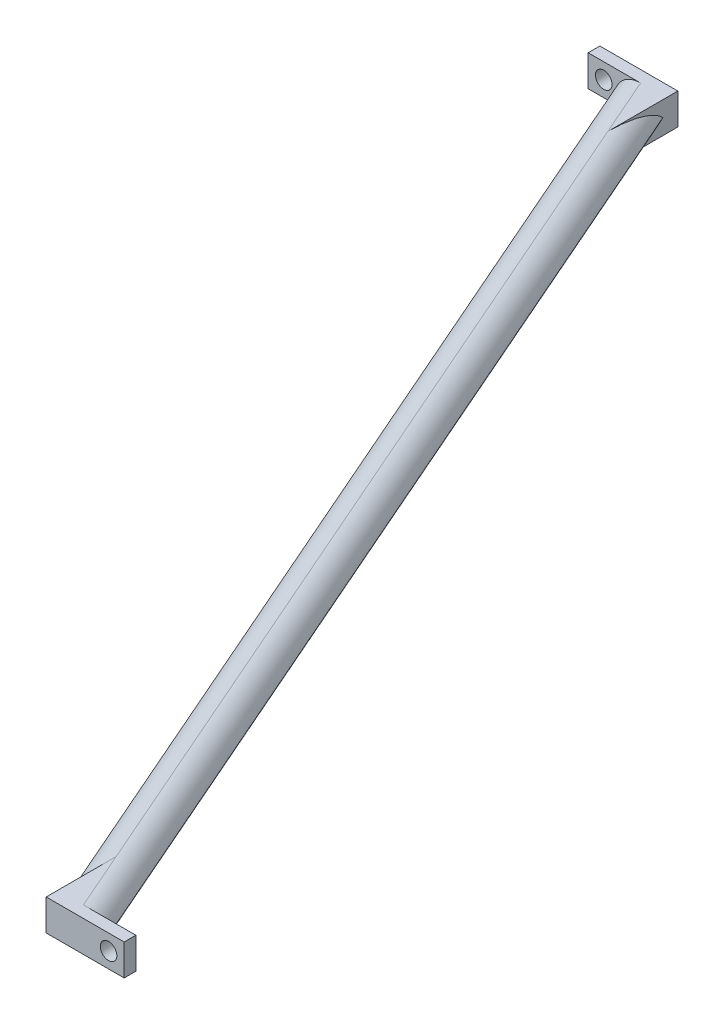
ISO-10303-21;
HEADER;
FILE_DESCRIPTION(('STEP AP214'),'2;1');
FILE_NAME('part.step','',(''),(''),'','','');
FILE_SCHEMA(('AUTOMOTIVE_DESIGN { 1 0 10303 214 1 1 1 1 }'));
ENDSEC;
DATA;
#1=APPLICATION_CONTEXT('core data for automotive mechanical design processes');
#2=APPLICATION_PROTOCOL_DEFINITION('international standard','automotive_design',2000,#1);
#3=PRODUCT_CONTEXT('',#1,'mechanical');
#4=PRODUCT('Part','Part','',(#3));
#5=PRODUCT_RELATED_PRODUCT_CATEGORY('part','',(#4));
#6=PRODUCT_DEFINITION_FORMATION('','',#4);
#7=PRODUCT_DEFINITION_CONTEXT('part definition',#1,'design');
#8=PRODUCT_DEFINITION('design','',#6,#7);
#9=PRODUCT_DEFINITION_SHAPE('','',#8);
#10=(LENGTH_UNIT() NAMED_UNIT(*) SI_UNIT(.MILLI.,.METRE.));
#11=(NAMED_UNIT(*) PLANE_ANGLE_UNIT() SI_UNIT($,.RADIAN.));
#12=(NAMED_UNIT(*) SI_UNIT($,.STERADIAN.) SOLID_ANGLE_UNIT());
#13=UNCERTAINTY_MEASURE_WITH_UNIT(LENGTH_MEASURE(1.E-05),#10,'distance_accuracy_value','');
#14=(GEOMETRIC_REPRESENTATION_CONTEXT(3) GLOBAL_UNCERTAINTY_ASSIGNED_CONTEXT((#13)) GLOBAL_UNIT_ASSIGNED_CONTEXT((#10,
#11,#12)) REPRESENTATION_CONTEXT('',''));
#15=CARTESIAN_POINT('',(0.,0.,0.));
#16=DIRECTION('',(0.,0.,1.));
#17=DIRECTION('',(1.,0.,0.));
#18=AXIS2_PLACEMENT_3D('',#15,#16,#17);
#19=CARTESIAN_POINT('',(0.,12.7,0.));
#20=DIRECTION('',(0.,1.,0.));
#21=DIRECTION('',(0.,0.,1.));
#22=AXIS2_PLACEMENT_3D('',#19,#20,#21);
#23=PLANE('',#22);
#24=DIRECTION('',(1.,0.,0.));
#25=VECTOR('',#24,1.);
#26=CARTESIAN_POINT('',(-273.05,12.7,4.7625));
#27=LINE('',#26,#25);
#28=CARTESIAN_POINT('',(-273.05,12.7,4.7625));
#29=VERTEX_POINT('',#28);
#30=CARTESIAN_POINT('',(-251.696275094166,12.7,4.7625));
#31=VERTEX_POINT('',#30);
#32=EDGE_CURVE('E124',#29,#31,#27,.T.);
#33=ORIENTED_EDGE('',*,*,#32,.T.);
#34=DIRECTION('',(0.400736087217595,0.,0.916193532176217));
#35=VECTOR('',#34,1.);
#36=CARTESIAN_POINT('',(-76.9982566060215,12.7,404.170488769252));
#37=LINE('',#36,#35);
#38=CARTESIAN_POINT('',(-241.3,12.7,28.5312602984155));
#39=VERTEX_POINT('',#38);
#40=EDGE_CURVE('E165',#31,#39,#37,.T.);
#41=ORIENTED_EDGE('',*,*,#40,.T.);
#42=DIRECTION('',(0.,0.,-1.));
#43=VECTOR('',#42,1.);
#44=CARTESIAN_POINT('',(-241.3,12.7,0.));
#45=LINE('',#44,#43);
#46=CARTESIAN_POINT('',(-241.3,12.7,0.));
#47=VERTEX_POINT('',#46);
#48=EDGE_CURVE('E214',#39,#47,#45,.T.);
#49=ORIENTED_EDGE('',*,*,#48,.T.);
#50=DIRECTION('',(-1.,0.,0.));
#51=VECTOR('',#50,1.);
#52=CARTESIAN_POINT('',(-273.05,12.7,0.));
#53=LINE('',#52,#51);
#54=CARTESIAN_POINT('',(-273.05,12.7,0.));
#55=VERTEX_POINT('',#54);
#56=EDGE_CURVE('E140',#47,#55,#53,.T.);
#57=ORIENTED_EDGE('',*,*,#56,.T.);
#58=DIRECTION('',(0.,0.,1.));
#59=VECTOR('',#58,1.);
#60=CARTESIAN_POINT('',(-273.05,12.7,0.));
#61=LINE('',#60,#59);
#62=EDGE_CURVE('E136',#55,#29,#61,.T.);
#63=ORIENTED_EDGE('',*,*,#62,.T.);
#64=EDGE_LOOP('',(#33,#41,#49,#57,#63));
#65=FACE_BOUND('',#64,.T.);
#66=ADVANCED_FACE('F33',(#65),#23,.T.);
#67=CARTESIAN_POINT('',(0.,0.,0.));
#68=DIRECTION('',(0.,1.,0.));
#69=DIRECTION('',(0.,0.,1.));
#70=AXIS2_PLACEMENT_3D('',#67,#68,#69);
#71=PLANE('',#70);
#72=DIRECTION('',(0.400736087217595,0.,0.916193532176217));
#73=VECTOR('',#72,1.);
#74=CARTESIAN_POINT('',(-213.025078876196,0.,93.1755503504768));
#75=LINE('',#74,#73);
#76=CARTESIAN_POINT('',(-241.3,0.,28.5312602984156));
#77=VERTEX_POINT('',#76);
#78=CARTESIAN_POINT('',(-251.696275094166,0.,4.76250000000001));
#79=VERTEX_POINT('',#78);
#80=EDGE_CURVE('E153',#77,#79,#75,.F.);
#81=ORIENTED_EDGE('',*,*,#80,.T.);
#82=DIRECTION('',(1.,0.,0.));
#83=VECTOR('',#82,1.);
#84=CARTESIAN_POINT('',(-273.05,0.,4.7625));
#85=LINE('',#84,#83);
#86=CARTESIAN_POINT('',(-273.05,0.,4.7625));
#87=VERTEX_POINT('',#86);
#88=EDGE_CURVE('E219',#87,#79,#85,.T.);
#89=ORIENTED_EDGE('',*,*,#88,.F.);
#90=DIRECTION('',(0.,0.,1.));
#91=VECTOR('',#90,1.);
#92=CARTESIAN_POINT('',(-273.05,0.,0.));
#93=LINE('',#92,#91);
#94=CARTESIAN_POINT('',(-273.05,0.,0.));
#95=VERTEX_POINT('',#94);
#96=EDGE_CURVE('E148',#95,#87,#93,.T.);
#97=ORIENTED_EDGE('',*,*,#96,.F.);
#98=DIRECTION('',(-1.,0.,0.));
#99=VECTOR('',#98,1.);
#100=CARTESIAN_POINT('',(-273.05,0.,0.));
#101=LINE('',#100,#99);
#102=CARTESIAN_POINT('',(-241.3,0.,0.));
#103=VERTEX_POINT('',#102);
#104=EDGE_CURVE('E144',#103,#95,#101,.T.);
#105=ORIENTED_EDGE('',*,*,#104,.F.);
#106=DIRECTION('',(0.,0.,-1.));
#107=VECTOR('',#106,1.);
#108=CARTESIAN_POINT('',(-241.3,0.,0.));
#109=LINE('',#108,#107);
#110=EDGE_CURVE('E229',#77,#103,#109,.T.);
#111=ORIENTED_EDGE('',*,*,#110,.F.);
#112=EDGE_LOOP('',(#81,#89,#97,#105,#111));
#113=FACE_BOUND('',#112,.T.);
#114=ADVANCED_FACE('F278',(#113),#71,.F.);
#115=CARTESIAN_POINT('',(-273.05,12.7,0.));
#116=DIRECTION('',(0.,0.,1.));
#117=DIRECTION('',(1.,0.,0.));
#118=AXIS2_PLACEMENT_3D('',#115,#116,#117);
#119=PLANE('',#118);
#120=ORIENTED_EDGE('',*,*,#104,.T.);
#121=DIRECTION('',(0.,-1.,0.));
#122=VECTOR('',#121,1.);
#123=CARTESIAN_POINT('',(-273.05,12.7,0.));
#124=LINE('',#123,#122);
#125=EDGE_CURVE('E217',#55,#95,#124,.T.);
#126=ORIENTED_EDGE('',*,*,#125,.F.);
#127=ORIENTED_EDGE('',*,*,#56,.F.);
#128=DIRECTION('',(0.,-1.,0.));
#129=VECTOR('',#128,1.);
#130=CARTESIAN_POINT('',(-241.3,12.7,0.));
#131=LINE('',#130,#129);
#132=EDGE_CURVE('E233',#47,#103,#131,.T.);
#133=ORIENTED_EDGE('',*,*,#132,.T.);
#134=EDGE_LOOP('',(#120,#126,#127,#133));
#135=FACE_BOUND('',#134,.T.);
#136=CARTESIAN_POINT('',(-266.7,6.35,0.));
#137=DIRECTION('',(0.,0.,-1.));
#138=DIRECTION('',(-1.,0.,0.));
#139=AXIS2_PLACEMENT_3D('',#136,#137,#138);
#140=CIRCLE('',#139,3.3782);
#141=CARTESIAN_POINT('',(-270.0782,6.35,0.));
#142=VERTEX_POINT('',#141);
#143=EDGE_CURVE('E199',#142,#142,#140,.T.);
#144=ORIENTED_EDGE('',*,*,#143,.F.);
#145=EDGE_LOOP('',(#144));
#146=FACE_BOUND('',#145,.T.);
#147=ADVANCED_FACE('F283',(#135,#146),#119,.F.);
#148=CARTESIAN_POINT('',(-273.05,12.7,0.));
#149=DIRECTION('',(1.,0.,0.));
#150=DIRECTION('',(0.,0.,-1.));
#151=AXIS2_PLACEMENT_3D('',#148,#149,#150);
#152=PLANE('',#151);
#153=ORIENTED_EDGE('',*,*,#96,.T.);
#154=DIRECTION('',(0.,-1.,0.));
#155=VECTOR('',#154,1.);
#156=CARTESIAN_POINT('',(-273.05,12.7,4.7625));
#157=LINE('',#156,#155);
#158=EDGE_CURVE('E128',#29,#87,#157,.T.);
#159=ORIENTED_EDGE('',*,*,#158,.F.);
#160=ORIENTED_EDGE('',*,*,#62,.F.);
#161=ORIENTED_EDGE('',*,*,#125,.T.);
#162=EDGE_LOOP('',(#153,#159,#160,#161));
#163=FACE_BOUND('',#162,.T.);
#164=ADVANCED_FACE('F146',(#163),#152,.F.);
#165=CARTESIAN_POINT('',(-273.05,12.7,4.7625));
#166=DIRECTION('',(0.,0.,-1.));
#167=DIRECTION('',(-1.,0.,0.));
#168=AXIS2_PLACEMENT_3D('',#165,#166,#167);
#169=PLANE('',#168);
#170=CARTESIAN_POINT('',(-266.7,6.35,4.7625));
#171=DIRECTION('',(0.,0.,-1.));
#172=DIRECTION('',(-1.,0.,0.));
#173=AXIS2_PLACEMENT_3D('',#170,#171,#172);
#174=CIRCLE('',#173,3.3782);
#175=CARTESIAN_POINT('',(-270.0782,6.35,4.7625));
#176=VERTEX_POINT('',#175);
#177=EDGE_CURVE('E204',#176,#176,#174,.T.);
#178=ORIENTED_EDGE('',*,*,#177,.T.);
#179=EDGE_LOOP('',(#178));
#180=FACE_BOUND('',#179,.T.);
#181=ORIENTED_EDGE('',*,*,#88,.T.);
#182=CARTESIAN_POINT('',(-251.696275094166,9.525,4.7625));
#183=DIRECTION('',(0.,0.,-1.));
#184=DIRECTION('',(1.,0.,0.));
#185=AXIS2_PLACEMENT_3D('',#182,#183,#184);
#186=ELLIPSE('',#185,10.3962750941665,9.525);
#187=CARTESIAN_POINT('',(-261.497977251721,6.35,4.7625));
#188=VERTEX_POINT('',#187);
#189=EDGE_CURVE('E170',#79,#188,#186,.T.);
#190=ORIENTED_EDGE('',*,*,#189,.T.);
#191=CARTESIAN_POINT('',(-251.696275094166,3.175,4.7625));
#192=DIRECTION('',(0.,0.,-1.));
#193=DIRECTION('',(-1.,0.,0.));
#194=AXIS2_PLACEMENT_3D('',#191,#192,#193);
#195=ELLIPSE('',#194,10.3962750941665,9.525);
#196=EDGE_CURVE('E131',#188,#31,#195,.T.);
#197=ORIENTED_EDGE('',*,*,#196,.T.);
#198=ORIENTED_EDGE('',*,*,#32,.F.);
#199=ORIENTED_EDGE('',*,*,#158,.T.);
#200=EDGE_LOOP('',(#181,#190,#197,#198,#199));
#201=FACE_BOUND('',#200,.T.);
#202=ADVANCED_FACE('F126',(#180,#201),#169,.F.);
#203=CARTESIAN_POINT('',(-85.7249999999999,12.7,407.9875));
#204=DIRECTION('',(1.,0.,0.));
#205=DIRECTION('',(0.,0.,-1.));
#206=AXIS2_PLACEMENT_3D('',#203,#204,#205);
#207=PLANE('',#206);
#208=DIRECTION('',(0.,0.,1.));
#209=VECTOR('',#208,1.);
#210=CARTESIAN_POINT('',(-85.7249999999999,0.,407.9875));
#211=LINE('',#210,#209);
#212=CARTESIAN_POINT('',(-85.7249999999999,0.,384.218739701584));
#213=VERTEX_POINT('',#212);
#214=CARTESIAN_POINT('',(-85.7249999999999,0.,412.75));
#215=VERTEX_POINT('',#214);
#216=EDGE_CURVE('E221',#213,#215,#211,.T.);
#217=ORIENTED_EDGE('',*,*,#216,.T.);
#218=DIRECTION('',(0.,-1.,0.));
#219=VECTOR('',#218,1.);
#220=CARTESIAN_POINT('',(-85.7249999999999,12.7,412.75));
#221=LINE('',#220,#219);
#222=CARTESIAN_POINT('',(-85.7249999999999,12.7,412.75));
#223=VERTEX_POINT('',#222);
#224=EDGE_CURVE('E150',#223,#215,#221,.T.);
#225=ORIENTED_EDGE('',*,*,#224,.F.);
#226=DIRECTION('',(0.,0.,1.));
#227=VECTOR('',#226,1.);
#228=CARTESIAN_POINT('',(-85.7249999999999,12.7,407.9875));
#229=LINE('',#228,#227);
#230=CARTESIAN_POINT('',(-85.7249999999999,12.7,384.218739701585));
#231=VERTEX_POINT('',#230);
#232=EDGE_CURVE('E135',#231,#223,#229,.T.);
#233=ORIENTED_EDGE('',*,*,#232,.F.);
#234=CARTESIAN_POINT('',(-85.7249999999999,3.175,384.218739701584));
#235=DIRECTION('',(1.,0.,0.));
#236=DIRECTION('',(0.,0.,-1.));
#237=AXIS2_PLACEMENT_3D('',#234,#235,#236);
#238=ELLIPSE('',#237,23.7687602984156,9.525);
#239=CARTESIAN_POINT('',(-85.7249999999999,6.35,406.628141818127));
#240=VERTEX_POINT('',#239);
#241=EDGE_CURVE('E175',#231,#240,#238,.T.);
#242=ORIENTED_EDGE('',*,*,#241,.T.);
#243=CARTESIAN_POINT('',(-85.7249999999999,9.525,384.218739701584));
#244=DIRECTION('',(1.,0.,0.));
#245=DIRECTION('',(0.,0.,1.));
#246=AXIS2_PLACEMENT_3D('',#243,#244,#245);
#247=ELLIPSE('',#246,23.7687602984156,9.525);
#248=EDGE_CURVE('E167',#240,#213,#247,.T.);
#249=ORIENTED_EDGE('',*,*,#248,.T.);
#250=EDGE_LOOP('',(#217,#225,#233,#242,#249));
#251=FACE_BOUND('',#250,.T.);
#252=ADVANCED_FACE('F260',(#251),#207,.F.);
#253=CARTESIAN_POINT('',(-85.7249999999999,12.7,412.75));
#254=DIRECTION('',(0.,0.,-1.));
#255=DIRECTION('',(-1.,0.,0.));
#256=AXIS2_PLACEMENT_3D('',#253,#254,#255);
#257=PLANE('',#256);
#258=CARTESIAN_POINT('',(-60.325,6.35,412.75));
#259=DIRECTION('',(0.,0.,1.));
#260=DIRECTION('',(1.,0.,0.));
#261=AXIS2_PLACEMENT_3D('',#258,#259,#260);
#262=CIRCLE('',#261,3.37819999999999);
#263=CARTESIAN_POINT('',(-56.9468,6.35,412.75));
#264=VERTEX_POINT('',#263);
#265=EDGE_CURVE('E190',#264,#264,#262,.T.);
#266=ORIENTED_EDGE('',*,*,#265,.F.);
#267=EDGE_LOOP('',(#266));
#268=FACE_BOUND('',#267,.T.);
#269=DIRECTION('',(1.,0.,0.));
#270=VECTOR('',#269,1.);
#271=CARTESIAN_POINT('',(-85.7249999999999,0.,412.75));
#272=LINE('',#271,#270);
#273=CARTESIAN_POINT('',(-53.9749999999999,0.,412.75));
#274=VERTEX_POINT('',#273);
#275=EDGE_CURVE('E223',#215,#274,#272,.T.);
#276=ORIENTED_EDGE('',*,*,#275,.T.);
#277=DIRECTION('',(0.,-1.,0.));
#278=VECTOR('',#277,1.);
#279=CARTESIAN_POINT('',(-53.9749999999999,12.7,412.75));
#280=LINE('',#279,#278);
#281=CARTESIAN_POINT('',(-53.9749999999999,12.7,412.75));
#282=VERTEX_POINT('',#281);
#283=EDGE_CURVE('E156',#282,#274,#280,.T.);
#284=ORIENTED_EDGE('',*,*,#283,.F.);
#285=DIRECTION('',(1.,0.,0.));
#286=VECTOR('',#285,1.);
#287=CARTESIAN_POINT('',(-85.7249999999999,12.7,412.75));
#288=LINE('',#287,#286);
#289=EDGE_CURVE('E208',#223,#282,#288,.T.);
#290=ORIENTED_EDGE('',*,*,#289,.F.);
#291=ORIENTED_EDGE('',*,*,#224,.T.);
#292=EDGE_LOOP('',(#276,#284,#290,#291));
#293=FACE_BOUND('',#292,.T.);
#294=ADVANCED_FACE('F258',(#268,#293),#257,.F.);
#295=CARTESIAN_POINT('',(-53.9749999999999,12.7,407.9875));
#296=DIRECTION('',(-1.,0.,0.));
#297=DIRECTION('',(0.,0.,1.));
#298=AXIS2_PLACEMENT_3D('',#295,#296,#297);
#299=PLANE('',#298);
#300=DIRECTION('',(0.,0.,-1.));
#301=VECTOR('',#300,1.);
#302=CARTESIAN_POINT('',(-53.9749999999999,0.,407.9875));
#303=LINE('',#302,#301);
#304=CARTESIAN_POINT('',(-53.9749999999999,0.,407.9875));
#305=VERTEX_POINT('',#304);
#306=EDGE_CURVE('E225',#274,#305,#303,.T.);
#307=ORIENTED_EDGE('',*,*,#306,.T.);
#308=DIRECTION('',(0.,-1.,0.));
#309=VECTOR('',#308,1.);
#310=CARTESIAN_POINT('',(-53.9749999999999,12.7,407.9875));
#311=LINE('',#310,#309);
#312=CARTESIAN_POINT('',(-53.9749999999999,12.7,407.9875));
#313=VERTEX_POINT('',#312);
#314=EDGE_CURVE('E236',#313,#305,#311,.T.);
#315=ORIENTED_EDGE('',*,*,#314,.F.);
#316=DIRECTION('',(0.,0.,-1.));
#317=VECTOR('',#316,1.);
#318=CARTESIAN_POINT('',(-53.9749999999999,12.7,407.9875));
#319=LINE('',#318,#317);
#320=EDGE_CURVE('E210',#282,#313,#319,.T.);
#321=ORIENTED_EDGE('',*,*,#320,.F.);
#322=ORIENTED_EDGE('',*,*,#283,.T.);
#323=EDGE_LOOP('',(#307,#315,#321,#322));
#324=FACE_BOUND('',#323,.T.);
#325=ADVANCED_FACE('F243',(#324),#299,.F.);
#326=CARTESIAN_POINT('',(-64.9324498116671,12.7,407.9875));
#327=DIRECTION('',(0.,0.,1.));
#328=DIRECTION('',(1.,0.,0.));
#329=AXIS2_PLACEMENT_3D('',#326,#327,#328);
#330=PLANE('',#329);
#331=CARTESIAN_POINT('',(-60.325,6.35,407.9875));
#332=DIRECTION('',(0.,0.,1.));
#333=DIRECTION('',(1.,0.,0.));
#334=AXIS2_PLACEMENT_3D('',#331,#332,#333);
#335=CIRCLE('',#334,3.37819999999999);
#336=CARTESIAN_POINT('',(-56.9468,6.35,407.9875));
#337=VERTEX_POINT('',#336);
#338=EDGE_CURVE('E194',#337,#337,#335,.T.);
#339=ORIENTED_EDGE('',*,*,#338,.T.);
#340=EDGE_LOOP('',(#339));
#341=FACE_BOUND('',#340,.T.);
#342=DIRECTION('',(-1.,0.,0.));
#343=VECTOR('',#342,1.);
#344=CARTESIAN_POINT('',(-64.9324498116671,0.,407.9875));
#345=LINE('',#344,#343);
#346=CARTESIAN_POINT('',(-75.3287249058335,0.,407.9875));
#347=VERTEX_POINT('',#346);
#348=EDGE_CURVE('E227',#305,#347,#345,.T.);
#349=ORIENTED_EDGE('',*,*,#348,.T.);
#350=CARTESIAN_POINT('',(-75.3287249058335,9.525,407.9875));
#351=DIRECTION('',(0.,0.,1.));
#352=DIRECTION('',(-1.,0.,0.));
#353=AXIS2_PLACEMENT_3D('',#350,#351,#352);
#354=ELLIPSE('',#353,10.3962750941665,9.525);
#355=CARTESIAN_POINT('',(-65.527022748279,6.35000000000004,407.9875));
#356=VERTEX_POINT('',#355);
#357=EDGE_CURVE('E49',#347,#356,#354,.T.);
#358=ORIENTED_EDGE('',*,*,#357,.T.);
#359=CARTESIAN_POINT('',(-75.3287249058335,3.175,407.9875));
#360=DIRECTION('',(0.,0.,1.));
#361=DIRECTION('',(1.,0.,0.));
#362=AXIS2_PLACEMENT_3D('',#359,#360,#361);
#363=ELLIPSE('',#362,10.3962750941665,9.525);
#364=CARTESIAN_POINT('',(-75.3287249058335,12.7,407.9875));
#365=VERTEX_POINT('',#364);
#366=EDGE_CURVE('E11',#356,#365,#363,.T.);
#367=ORIENTED_EDGE('',*,*,#366,.T.);
#368=DIRECTION('',(-1.,0.,0.));
#369=VECTOR('',#368,1.);
#370=CARTESIAN_POINT('',(-64.9324498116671,12.7,407.9875));
#371=LINE('',#370,#369);
#372=EDGE_CURVE('E212',#313,#365,#371,.T.);
#373=ORIENTED_EDGE('',*,*,#372,.F.);
#374=ORIENTED_EDGE('',*,*,#314,.T.);
#375=EDGE_LOOP('',(#349,#358,#367,#373,#374));
#376=FACE_BOUND('',#375,.T.);
#377=ADVANCED_FACE('F252',(#341,#376),#330,.F.);
#378=CARTESIAN_POINT('',(-241.3,12.7,0.));
#379=DIRECTION('',(-1.,0.,0.));
#380=DIRECTION('',(0.,0.,1.));
#381=AXIS2_PLACEMENT_3D('',#378,#379,#380);
#382=PLANE('',#381);
#383=ORIENTED_EDGE('',*,*,#110,.T.);
#384=ORIENTED_EDGE('',*,*,#132,.F.);
#385=ORIENTED_EDGE('',*,*,#48,.F.);
#386=CARTESIAN_POINT('',(-241.3,3.175,28.5312602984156));
#387=DIRECTION('',(-1.,0.,0.));
#388=DIRECTION('',(0.,0.,1.));
#389=AXIS2_PLACEMENT_3D('',#386,#387,#388);
#390=ELLIPSE('',#389,23.7687602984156,9.525);
#391=CARTESIAN_POINT('',(-241.3,6.35000000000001,6.12185818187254));
#392=VERTEX_POINT('',#391);
#393=EDGE_CURVE('E42',#39,#392,#390,.T.);
#394=ORIENTED_EDGE('',*,*,#393,.T.);
#395=CARTESIAN_POINT('',(-241.3,9.525,28.5312602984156));
#396=DIRECTION('',(-1.,0.,0.));
#397=DIRECTION('',(0.,0.,-1.));
#398=AXIS2_PLACEMENT_3D('',#395,#396,#397);
#399=ELLIPSE('',#398,23.7687602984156,9.525);
#400=EDGE_CURVE('E172',#392,#77,#399,.T.);
#401=ORIENTED_EDGE('',*,*,#400,.T.);
#402=EDGE_LOOP('',(#383,#384,#385,#394,#401));
#403=FACE_BOUND('',#402,.T.);
#404=ADVANCED_FACE('F288',(#403),#382,.F.);
#405=DIRECTION('',(-0.400736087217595,0.,-0.916193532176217));
#406=VECTOR('',#405,1.);
#407=CARTESIAN_POINT('',(-250.026743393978,12.7,8.57951123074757));
#408=LINE('',#407,#406);
#409=EDGE_CURVE('E162',#365,#231,#408,.T.);
#410=ORIENTED_EDGE('',*,*,#409,.T.);
#411=ORIENTED_EDGE('',*,*,#232,.T.);
#412=ORIENTED_EDGE('',*,*,#289,.T.);
#413=ORIENTED_EDGE('',*,*,#320,.T.);
#414=ORIENTED_EDGE('',*,*,#372,.T.);
#415=EDGE_LOOP('',(#410,#411,#412,#413,#414));
#416=FACE_BOUND('',#415,.T.);
#417=ADVANCED_FACE('F256',(#416),#23,.T.);
#418=ORIENTED_EDGE('',*,*,#216,.F.);
#419=DIRECTION('',(-0.400736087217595,0.,-0.916193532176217));
#420=VECTOR('',#419,1.);
#421=CARTESIAN_POINT('',(-213.025078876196,0.,93.1755503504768));
#422=LINE('',#421,#420);
#423=EDGE_CURVE('E149',#213,#347,#422,.F.);
#424=ORIENTED_EDGE('',*,*,#423,.T.);
#425=ORIENTED_EDGE('',*,*,#348,.F.);
#426=ORIENTED_EDGE('',*,*,#306,.F.);
#427=ORIENTED_EDGE('',*,*,#275,.F.);
#428=EDGE_LOOP('',(#418,#424,#425,#426,#427));
#429=FACE_BOUND('',#428,.T.);
#430=ADVANCED_FACE('F250',(#429),#71,.F.);
#431=CARTESIAN_POINT('',(-266.7,6.35,0.));
#432=DIRECTION('',(0.,0.,-1.));
#433=DIRECTION('',(-1.,0.,0.));
#434=AXIS2_PLACEMENT_3D('',#431,#432,#433);
#435=CYLINDRICAL_SURFACE('',#434,3.3782);
#436=ORIENTED_EDGE('',*,*,#177,.F.);
#437=EDGE_LOOP('',(#436));
#438=FACE_BOUND('',#437,.T.);
#439=ORIENTED_EDGE('',*,*,#143,.T.);
#440=EDGE_LOOP('',(#439));
#441=FACE_BOUND('',#440,.T.);
#442=ADVANCED_FACE('F293',(#438,#441),#435,.F.);
#443=CARTESIAN_POINT('',(-60.325,6.35,412.75));
#444=DIRECTION('',(0.,0.,1.));
#445=DIRECTION('',(1.,0.,0.));
#446=AXIS2_PLACEMENT_3D('',#443,#444,#445);
#447=CYLINDRICAL_SURFACE('',#446,3.37819999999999);
#448=ORIENTED_EDGE('',*,*,#338,.F.);
#449=EDGE_LOOP('',(#448));
#450=FACE_BOUND('',#449,.T.);
#451=ORIENTED_EDGE('',*,*,#265,.T.);
#452=EDGE_LOOP('',(#451));
#453=FACE_BOUND('',#452,.T.);
#454=ADVANCED_FACE('F275',(#450,#453),#447,.F.);
#455=CARTESIAN_POINT('',(-213.025078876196,3.175,93.1755503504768));
#456=DIRECTION('',(0.400736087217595,0.,0.916193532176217));
#457=DIRECTION('',(0.916193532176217,0.,-0.400736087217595));
#458=AXIS2_PLACEMENT_3D('',#455,#456,#457);
#459=CYLINDRICAL_SURFACE('',#458,9.525);
#460=ORIENTED_EDGE('',*,*,#409,.F.);
#461=ORIENTED_EDGE('',*,*,#366,.F.);
#462=DIRECTION('',(0.400736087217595,0.,0.916193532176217));
#463=VECTOR('',#462,1.);
#464=CARTESIAN_POINT('',(-153.615315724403,6.35000000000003,206.593298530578));
#465=LINE('',#464,#463);
#466=EDGE_CURVE('E37',#392,#356,#465,.T.);
#467=ORIENTED_EDGE('',*,*,#466,.F.);
#468=ORIENTED_EDGE('',*,*,#393,.F.);
#469=DIRECTION('',(-0.400736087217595,0.,-0.916193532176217));
#470=VECTOR('',#469,1.);
#471=CARTESIAN_POINT('',(-250.026743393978,12.7,8.57951123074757));
#472=LINE('',#471,#470);
#473=EDGE_CURVE('E184',#231,#39,#472,.T.);
#474=ORIENTED_EDGE('',*,*,#473,.F.);
#475=EDGE_LOOP('',(#460,#461,#467,#468,#474));
#476=FACE_BOUND('',#475,.T.);
#477=ADVANCED_FACE('F35',(#476),#459,.T.);
#478=CARTESIAN_POINT('',(-73.6591932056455,9.525,411.804511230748));
#479=DIRECTION('',(-0.400736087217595,0.,-0.916193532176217));
#480=DIRECTION('',(-0.916193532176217,0.,0.400736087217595));
#481=AXIS2_PLACEMENT_3D('',#478,#479,#480);
#482=CYLINDRICAL_SURFACE('',#481,9.525);
#483=ORIENTED_EDGE('',*,*,#357,.F.);
#484=ORIENTED_EDGE('',*,*,#423,.F.);
#485=DIRECTION('',(-0.400736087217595,0.,-0.916193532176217));
#486=VECTOR('',#485,1.);
#487=CARTESIAN_POINT('',(-213.025078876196,0.,93.1755503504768));
#488=LINE('',#487,#486);
#489=EDGE_CURVE('E182',#77,#213,#488,.F.);
#490=ORIENTED_EDGE('',*,*,#489,.F.);
#491=ORIENTED_EDGE('',*,*,#400,.F.);
#492=ORIENTED_EDGE('',*,*,#466,.T.);
#493=EDGE_LOOP('',(#483,#484,#490,#491,#492));
#494=FACE_BOUND('',#493,.T.);
#495=ADVANCED_FACE('F267',(#494),#482,.T.);
#496=CARTESIAN_POINT('',(-213.025078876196,3.175,93.1755503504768));
#497=DIRECTION('',(-0.400736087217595,0.,-0.916193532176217));
#498=DIRECTION('',(-0.916193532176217,0.,0.400736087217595));
#499=AXIS2_PLACEMENT_3D('',#496,#497,#498);
#500=CYLINDRICAL_SURFACE('',#499,9.525);
#501=ORIENTED_EDGE('',*,*,#40,.F.);
#502=ORIENTED_EDGE('',*,*,#196,.F.);
#503=DIRECTION('',(-0.400736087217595,0.,-0.916193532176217));
#504=VECTOR('',#503,1.);
#505=CARTESIAN_POINT('',(-173.409684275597,6.35,206.156701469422));
#506=LINE('',#505,#504);
#507=EDGE_CURVE('E179',#240,#188,#506,.T.);
#508=ORIENTED_EDGE('',*,*,#507,.F.);
#509=ORIENTED_EDGE('',*,*,#241,.F.);
#510=ORIENTED_EDGE('',*,*,#473,.T.);
#511=EDGE_LOOP('',(#501,#502,#508,#509,#510));
#512=FACE_BOUND('',#511,.T.);
#513=ADVANCED_FACE('F269',(#512),#500,.T.);
#514=CARTESIAN_POINT('',(-253.365806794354,9.525,0.945488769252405));
#515=DIRECTION('',(0.400736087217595,0.,0.916193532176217));
#516=DIRECTION('',(0.916193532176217,0.,-0.400736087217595));
#517=AXIS2_PLACEMENT_3D('',#514,#515,#516);
#518=CYLINDRICAL_SURFACE('',#517,9.525);
#519=ORIENTED_EDGE('',*,*,#80,.F.);
#520=ORIENTED_EDGE('',*,*,#489,.T.);
#521=ORIENTED_EDGE('',*,*,#248,.F.);
#522=ORIENTED_EDGE('',*,*,#507,.T.);
#523=ORIENTED_EDGE('',*,*,#189,.F.);
#524=EDGE_LOOP('',(#519,#520,#521,#522,#523));
#525=FACE_BOUND('',#524,.T.);
#526=ADVANCED_FACE('F265',(#525),#518,.T.);
#527=CLOSED_SHELL('',(#66,#114,#147,#164,#202,#252,#294,#325,#377,#404,#417,#430,#442,#454,#477,
#495,#513,#526));
#528=MANIFOLD_SOLID_BREP('B2',#527);
#529=ADVANCED_BREP_SHAPE_REPRESENTATION('',(#18,#528),#14);
#530=SHAPE_DEFINITION_REPRESENTATION(#9,#529);
ENDSEC;
END-ISO-10303-21;
